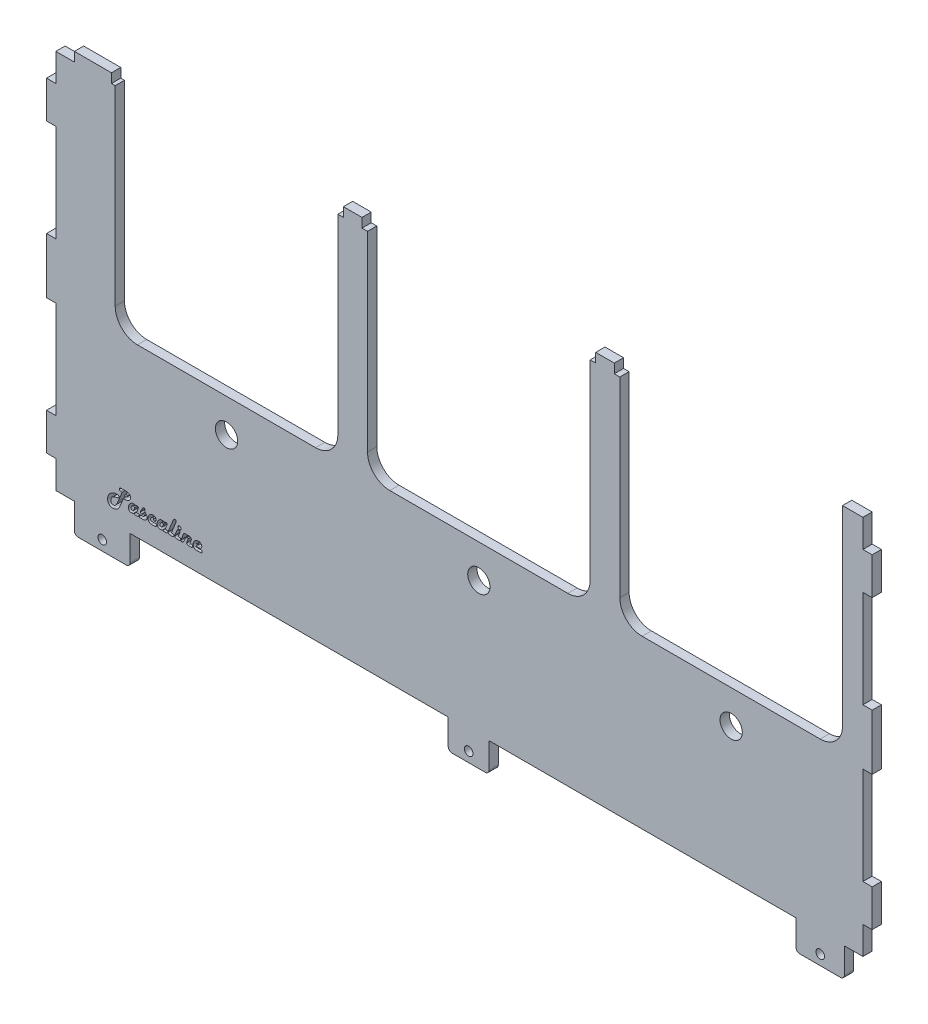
from build123d import *

# Parameters (mm, degrees)
SKETCH1_R             = 3.81
BOSS_EXTRUDE1_DEPTH   = 3.175
FILLET1_R             = 7.62
SKETCH2_W             = 6.35
SKETCH2_H             = 3.175
SKETCH2_W_2           = 3.175
SKETCH2_H_2           = 12.7
SKETCH2_H_3           = 19.05
SKETCH2_W_3           = 19.05
SKETCH2_H_4           = 10.033
SKETCH2_W_4           = 13.97
SKETCH2_W_5           = 16.51
SKETCH2_W_6           = 12.7
BOSS_EXTRUDE2_DEPTH   = 3.175
F_4_CLEARANCE_HOLE1_D = 2.9464
FILLET2_R             = 1.27
CUT_EXTRUDE1_DEPTH    = 310.607272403


with BuildPart() as part:
    # Sketch1 → Boss-Extrude1 (new body)
    with BuildSketch(Plane.XY):
        Polygon((0, 0), (276.225, 0), (276.225, 130.175), (269.24, 130.175), (269.24, 57.15), (193.04, 57.15), (193.04, 130.175), (182.88, 130.175), (182.88, 57.15), (106.68, 57.15), (106.68, 130.175), (96.52, 130.175), (96.52, 57.15), (20.32, 57.15), (20.32, 130.175), (0, 130.175), align=None)
        with Locations((231.14, 45.72)):
            Circle(SKETCH1_R, mode=Mode.SUBTRACT)
        with Locations((58.42, 45.72)):
            Circle(SKETCH1_R, mode=Mode.SUBTRACT)
        with Locations(Location((144.78, 45.72, 0), (0, 0, 180))):
            Circle(SKETCH1_R, mode=Mode.SUBTRACT)
    extrude(amount=BOSS_EXTRUDE1_DEPTH)

    # Fillet1
    fillet1_edges = [part.edges().sort_by_distance(p)[0] for p in [
        (20.32, 57.15, 1.5875),
        (96.52, 57.15, 1.5875),
        (106.68, 57.15, 1.5875),
        (182.88, 57.15, 1.5875),
        (193.04, 57.15, 1.5875),
        (269.24, 57.15, 1.5875),
    ]]
    fillet(fillet1_edges, radius=FILLET1_R)

    # Sketch2 → Boss-Extrude2 (add)
    with BuildSketch(Plane.XY):
        with Locations((187.96, 131.7625)):
            Rectangle(SKETCH2_W, SKETCH2_H)
        with Locations((277.8125, 114.3)):
            Rectangle(SKETCH2_W_2, SKETCH2_H_2)
        with Locations((277.8125, 15.875)):
            Rectangle(SKETCH2_W_2, SKETCH2_H_2)
        with Locations((-1.5875, 65.0875)):
            Rectangle(SKETCH2_W_2, SKETCH2_H_3)
        with Locations((277.8125, 65.0875)):
            Rectangle(SKETCH2_W_2, SKETCH2_H_3)
        with Locations((-1.5875, 15.875)):
            Rectangle(SKETCH2_W_2, SKETCH2_H_2)
        with Locations((-1.5875, 114.3)):
            Rectangle(SKETCH2_W_2, SKETCH2_H_2)
        with Locations((15.875, -5.0165)):
            Rectangle(SKETCH2_W_3, SKETCH2_H_4)
        with Locations((141.2875, -5.0165)):
            Rectangle(SKETCH2_W_4, SKETCH2_H_4)
        with Locations((261.62, -5.0165)):
            Rectangle(SKETCH2_W_5, SKETCH2_H_4)
        with Locations((101.6, 131.7625)):
            Rectangle(SKETCH2_W, SKETCH2_H)
        with Locations((12.7, 131.7625)):
            Rectangle(SKETCH2_W_6, SKETCH2_H)
    extrude(amount=BOSS_EXTRUDE2_DEPTH)

    # 4 Clearance Hole1 (through all)
    with Locations(Plane.XY.offset(3.175)):
        with Locations((141.2875, -6.604), (261.62, -6.604), (15.875, -6.604)):
            Hole(F_4_CLEARANCE_HOLE1_D / 2)

    # Fillet2
    fillet2_edges = [part.edges().sort_by_distance(p)[0] for p in [
        (269.875, -10.033, 1.5875),
        (253.365, -10.033, 1.5875),
        (148.2725, -10.033, 1.5875),
        (134.3025, -10.033, 1.5875),
        (25.4, -10.033, 1.5875),
        (6.35, -10.033, 1.5875),
    ]]
    fillet(fillet2_edges, radius=FILLET2_R)

    # Sketch5 → Cut-Extrude1 (cut, through all)
    # profile 1 of 10: a face of its own
    with BuildSketch(Plane.XY.offset(3.175)):
        with BuildLine():
            Line((23.119201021, 9.164609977), (22.451206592, 7.500566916))
            add(Edge.make_bspline(
                [(22.451206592, 7.500566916), (22.411003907, 7.401430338), (22.333829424, 7.211124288), (22.219435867, 6.938643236), (22.112680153, 6.690113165), (22.012786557, 6.465475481), (21.920717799, 6.264069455), (21.833533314, 6.087517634), (21.755963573, 5.933870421), (21.661354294, 5.762755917), (21.539114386, 5.572432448), (21.375027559, 5.364837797), (21.194459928, 5.172753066), (21.060129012, 5.059889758), (20.992791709, 5.003313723)],
                knots=[0, 0, 0, 0, 1.315970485, 2.526183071, 3.635244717, 4.643279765, 5.550454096, 6.359128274, 7.065363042, 7.667512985, 8.763908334, 9.843272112, 10.918877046, 12, 12, 12, 12], degree=3))
            add(Edge.make_bspline(
                [(20.992791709, 5.003313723), (20.941866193, 4.965231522), (20.841070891, 4.889856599), (20.680401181, 4.792052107), (20.514563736, 4.708473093), (20.341573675, 4.641675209), (20.163005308, 4.589417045), (19.978244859, 4.551262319), (19.787353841, 4.528037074), (19.658056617, 4.52556047), (19.592618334, 4.524307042)],
                knots=[0, 0, 0, 0, 1.011044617, 2.001129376, 2.987597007, 3.961339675, 4.946518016, 5.943976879, 6.959431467, 8, 8, 8, 8], degree=3))
            add(Edge.make_bspline(
                [(19.592618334, 4.524307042), (19.523985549, 4.52577862), (19.389812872, 4.52865546), (19.193870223, 4.554855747), (19.007122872, 4.594062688), (18.83078106, 4.653339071), (18.663334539, 4.726507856), (18.506601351, 4.817898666), (18.35966799, 4.925082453), (18.22480845, 5.048815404), (18.102569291, 5.184697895), (17.996369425, 5.332046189), (17.904994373, 5.488467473), (17.831448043, 5.655681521), (17.774055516, 5.832504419), (17.734367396, 6.018966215), (17.708307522, 6.214954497), (17.70541107, 6.3491208), (17.70392946, 6.417750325)],
                knots=[0, 0, 0, 0, 1.095039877, 2.140732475, 3.150521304, 4.13652018, 5.104897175, 6.062745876, 7.026672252, 8.00261995, 8.979018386, 9.939223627, 10.897072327, 11.865449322, 12.849478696, 13.859267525, 14.904960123, 16, 16, 16, 16], degree=3))
            add(Edge.make_bspline(
                [(17.70392946, 6.417750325), (17.706469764, 6.510196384), (17.711485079, 6.692712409), (17.750571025, 6.961954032), (17.814671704, 7.222484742), (17.905671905, 7.473969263), (18.021297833, 7.716830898), (18.16431112, 7.949570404), (18.332042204, 8.17426002), (18.460931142, 8.313119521), (18.526442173, 8.383698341)],
                knots=[0, 0, 0, 0, 1.01377589, 2.001495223, 2.977585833, 3.952291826, 4.930103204, 5.92294397, 6.944284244, 8, 8, 8, 8], degree=3))
            add(Edge.make_bspline(
                [(18.526442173, 8.383698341), (18.564038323, 8.421013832), (18.639923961, 8.496332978), (18.762383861, 8.601213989), (18.891389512, 8.701406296), (19.026342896, 8.796968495), (19.169837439, 8.884085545), (19.318539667, 8.968473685), (19.475608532, 9.044630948), (19.690708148, 9.141268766), (19.965425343, 9.241006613), (20.2978387, 9.328678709), (20.629749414, 9.381793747), (20.850767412, 9.389158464), (20.96069945, 9.392821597)],
                knots=[0, 0, 0, 0, 0.706155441, 1.425333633, 2.148189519, 2.883981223, 3.628821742, 4.385725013, 5.163077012, 5.955384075, 7.529784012, 9.053423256, 10.534403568, 12, 12, 12, 12], degree=3))
            add(Edge.make_bspline(
                [(20.96069945, 9.392821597), (21.010777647, 9.391629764), (21.10661754, 9.389348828), (21.242284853, 9.36101028), (21.363435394, 9.317754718), (21.467338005, 9.255678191), (21.552788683, 9.180085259), (21.616087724, 9.091135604), (21.653226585, 8.989078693), (21.657440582, 8.917283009), (21.659597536, 8.880534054)],
                knots=[0, 0, 0, 0, 1.238826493, 2.370872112, 3.417595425, 4.41258701, 5.350953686, 6.225146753, 7.091533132, 8, 8, 8, 8], degree=3))
            add(Edge.make_bspline(
                [(21.659597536, 8.880534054), (21.657158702, 8.841764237), (21.65240403, 8.766179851), (21.612518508, 8.658791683), (21.545055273, 8.564566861), (21.48423124, 8.515858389), (21.452780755, 8.490672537)],
                knots=[0, 0, 0, 0, 1.010937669, 1.970891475, 2.950802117, 4, 4, 4, 4], degree=3))
            add(Edge.make_bspline(
                [(21.452780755, 8.490672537), (21.428650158, 8.476261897), (21.374303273, 8.443806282), (21.271172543, 8.413087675), (21.142728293, 8.387298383), (21.04721528, 8.377274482), (20.995168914, 8.371812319)],
                knots=[0, 0, 0, 0, 0.704559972, 1.586808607, 2.68501851, 4, 4, 4, 4], degree=3))
            add(Edge.make_bspline(
                [(20.995168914, 8.371812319), (20.930899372, 8.36533971), (20.80556437, 8.352717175), (20.622961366, 8.323144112), (20.44919412, 8.289935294), (20.285218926, 8.246571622), (20.130183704, 8.19766871), (19.983692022, 8.144126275), (19.847574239, 8.080489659), (19.761927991, 8.032764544), (19.719798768, 8.009288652)],
                knots=[0, 0, 0, 0, 1.159710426, 2.261604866, 3.320677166, 4.335395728, 5.305245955, 6.239579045, 7.134052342, 8, 8, 8, 8], degree=3))
            add(Edge.make_bspline(
                [(19.719798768, 8.009288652), (19.654419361, 7.967339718), (19.52562533, 7.884702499), (19.354426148, 7.733222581), (19.203332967, 7.564964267), (19.075629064, 7.379109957), (18.973627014, 7.181271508), (18.89879096, 6.976254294), (18.852926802, 6.765270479), (18.847636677, 6.622412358), (18.844987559, 6.550873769)],
                knots=[0, 0, 0, 0, 1.047576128, 2.063670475, 3.075290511, 4.094745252, 5.099666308, 6.072755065, 7.034899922, 8, 8, 8, 8], degree=3))
            add(Edge.make_bspline(
                [(18.844987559, 6.550873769), (18.845636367, 6.515185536), (18.846908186, 6.445228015), (18.857899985, 6.343133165), (18.875018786, 6.246246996), (18.901788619, 6.15588907), (18.933862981, 6.070634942), (18.972695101, 5.990387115), (19.020918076, 5.917086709), (19.073977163, 5.848438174), (19.13513267, 5.788442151), (19.199905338, 5.73415304), (19.271326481, 5.690354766), (19.346543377, 5.652700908), (19.427352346, 5.624580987), (19.513023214, 5.604540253), (19.603256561, 5.590584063), (19.665464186, 5.589730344), (19.697215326, 5.589294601)],
                knots=[0, 0, 0, 0, 1.180906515, 2.314860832, 3.395146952, 4.432720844, 5.428859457, 6.408284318, 7.375873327, 8.328235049, 9.274073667, 10.205991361, 11.119268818, 12.040047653, 12.985704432, 13.943108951, 14.9501506, 16, 16, 16, 16], degree=3))
            add(Edge.make_bspline(
                [(19.697215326, 5.589294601), (19.73772721, 5.590178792), (19.817696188, 5.591924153), (19.934736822, 5.613557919), (20.047745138, 5.64535598), (20.156538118, 5.691126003), (20.261491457, 5.749525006), (20.361851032, 5.821430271), (20.457232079, 5.906838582), (20.550130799, 6.005691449), (20.640514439, 6.122252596), (20.735291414, 6.255321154), (20.829339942, 6.410668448), (20.926497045, 6.585296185), (21.026287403, 6.779583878), (21.128874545, 6.99369617), (21.231187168, 7.22917089), (21.299659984, 7.393110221), (21.335109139, 7.477983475)],
                knots=[0, 0, 0, 0, 0.731682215, 1.444313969, 2.14503258, 2.851587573, 3.573238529, 4.31284086, 5.079201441, 5.885132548, 6.76239785, 7.744387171, 8.838039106, 10.04403949, 11.357848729, 12.787140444, 14.336666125, 16, 16, 16, 16], degree=3))
            Line((21.335109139, 7.477983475), (22.730528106, 10.914232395))
            Line((22.730528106, 10.914232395), (22.293122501, 10.914232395))
            add(Edge.make_bspline(
                [(22.293122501, 10.914232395), (22.249482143, 10.915318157), (22.167784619, 10.917350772), (22.053469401, 10.933486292), (21.955911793, 10.96103767), (21.875553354, 11.001448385), (21.812083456, 11.0538411), (21.766552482, 11.118910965), (21.739607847, 11.196317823), (21.737016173, 11.251577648), (21.735668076, 11.280321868)],
                knots=[0, 0, 0, 0, 1.386647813, 2.595892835, 3.659749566, 4.594681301, 5.434731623, 6.248703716, 7.089037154, 8, 8, 8, 8], degree=3))
            add(Edge.make_bspline(
                [(21.735668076, 11.280321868), (21.737604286, 11.321461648), (21.741339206, 11.400819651), (21.780099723, 11.512122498), (21.841922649, 11.609323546), (21.930694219, 11.688476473), (22.040352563, 11.751577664), (22.17060237, 11.796320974), (22.320267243, 11.821779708), (22.426142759, 11.825246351), (22.482110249, 11.827078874)],
                knots=[0, 0, 0, 0, 0.942601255, 1.818263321, 2.674766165, 3.564433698, 4.523656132, 5.566505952, 6.713616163, 8, 8, 8, 8], degree=3))
            Line((22.482110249, 11.827078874), (24.009464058, 11.827078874))
            add(Edge.make_bspline(
                [(24.009464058, 11.827078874), (24.07248493, 11.826141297), (24.194705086, 11.824322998), (24.371659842, 11.811086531), (24.536158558, 11.790426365), (24.687661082, 11.7598162), (24.826003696, 11.719494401), (24.951704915, 11.670604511), (25.065549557, 11.614116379), (25.166457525, 11.546868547), (25.254881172, 11.47075861), (25.331318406, 11.384834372), (25.394973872, 11.289168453), (25.449869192, 11.185035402), (25.489653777, 11.069843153), (25.51766631, 10.945418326), (25.536143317, 10.81176616), (25.53815736, 10.719365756), (25.539195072, 10.671757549)],
                knots=[0, 0, 0, 0, 1.377685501, 2.671828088, 3.877302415, 5.000186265, 6.047243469, 7.023626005, 7.94558449, 8.820055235, 9.667510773, 10.489711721, 11.325757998, 12.174186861, 13.056345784, 13.980864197, 14.959664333, 16, 16, 16, 16], degree=3))
            add(Edge.make_bspline(
                [(25.539195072, 10.671757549), (25.537217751, 10.613032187), (25.533336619, 10.497764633), (25.507219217, 10.328808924), (25.461558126, 10.168586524), (25.398541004, 10.016101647), (25.315426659, 9.873155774), (25.215734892, 9.73744145), (25.098243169, 9.609536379), (25.007634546, 9.534438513), (24.961534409, 9.496229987)],
                knots=[0, 0, 0, 0, 1.037190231, 2.03582197, 3.010506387, 3.973515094, 4.942177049, 5.923321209, 6.943420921, 8, 8, 8, 8], degree=3))
            add(Edge.make_bspline(
                [(24.961534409, 9.496229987), (24.924861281, 9.469591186), (24.849567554, 9.414898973), (24.722279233, 9.347795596), (24.581294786, 9.290628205), (24.42582274, 9.24494617), (24.257052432, 9.208122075), (24.073914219, 9.182358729), (23.876613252, 9.166850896), (23.740077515, 9.16537344), (23.669523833, 9.164609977)],
                knots=[0, 0, 0, 0, 0.800437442, 1.643380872, 2.535600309, 3.486195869, 4.50417187, 5.586788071, 6.752993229, 8, 8, 8, 8], degree=3))
            Line((23.669523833, 9.164609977), (23.119201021, 9.164609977))
        make_face()
        with BuildLine():
            Line((23.509062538, 10.077456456), (23.833550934, 10.077456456))
            add(Edge.make_bspline(
                [(23.833550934, 10.077456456), (23.883581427, 10.078871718), (23.978009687, 10.081542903), (24.109812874, 10.105830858), (24.222265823, 10.147368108), (24.315221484, 10.206091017), (24.38842248, 10.283422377), (24.437974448, 10.379084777), (24.470358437, 10.489814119), (24.47287967, 10.569284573), (24.474207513, 10.611138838)],
                knots=[0, 0, 0, 0, 1.258971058, 2.376199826, 3.358208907, 4.260347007, 5.121448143, 6.005251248, 6.949436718, 8, 8, 8, 8], degree=3))
            add(Edge.make_bspline(
                [(24.474207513, 10.611138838), (24.473067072, 10.634992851), (24.470906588, 10.680182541), (24.45485612, 10.743618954), (24.424912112, 10.796445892), (24.384765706, 10.841296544), (24.331090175, 10.873849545), (24.267531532, 10.898068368), (24.192697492, 10.911946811), (24.139079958, 10.913437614), (24.110495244, 10.914232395)],
                knots=[0, 0, 0, 0, 1.057975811, 2.004258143, 2.869579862, 3.727735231, 4.644179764, 5.623179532, 6.73286349, 8, 8, 8, 8], degree=3))
            Line((24.110495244, 10.914232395), (23.84187115, 10.914232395))
            Line((23.84187115, 10.914232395), (23.509062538, 10.077456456))
        make_face(mode=Mode.SUBTRACT)
    # profile 2 of 10: a face of its own
    with BuildSketch(Plane.XY.offset(3.175)):
        with BuildLine():
            Line((27.590722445, 7.262846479), (28.032882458, 7.262846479))
            add(Edge.make_bspline(
                [(28.032882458, 7.262846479), (28.069771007, 7.26168404), (28.139217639, 7.259495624), (28.237100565, 7.244044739), (28.319497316, 7.213913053), (28.389453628, 7.175207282), (28.441730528, 7.120759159), (28.479643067, 7.055670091), (28.502815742, 6.978700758), (28.504866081, 6.923472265), (28.505946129, 6.894379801)],
                knots=[0, 0, 0, 0, 1.294214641, 2.436497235, 3.45633191, 4.35958604, 5.214514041, 6.067746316, 6.982155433, 8, 8, 8, 8], degree=3))
            add(Edge.make_bspline(
                [(28.505946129, 6.894379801), (28.504075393, 6.853751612), (28.500488, 6.775841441), (28.467922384, 6.66547908), (28.411237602, 6.570686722), (28.335484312, 6.489620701), (28.239850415, 6.426705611), (28.127852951, 6.380604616), (27.999107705, 6.355527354), (27.90818237, 6.351900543), (27.860535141, 6.35)],
                knots=[0, 0, 0, 0, 1.02006706, 1.956119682, 2.85821293, 3.77438774, 4.72208319, 5.713685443, 6.801912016, 8, 8, 8, 8], degree=3))
            Line((27.860535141, 6.35), (27.347058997, 6.35))
            add(Edge.make_bspline(
                [(27.347058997, 6.35), (27.319272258, 6.350924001), (27.266140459, 6.35269081), (27.189661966, 6.365809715), (27.119931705, 6.388489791), (27.056725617, 6.420297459), (27.001086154, 6.461923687), (26.951568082, 6.511009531), (26.909321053, 6.570088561), (26.888358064, 6.614676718), (26.877561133, 6.637641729)],
                knots=[0, 0, 0, 0, 1.135602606, 2.17141737, 3.159933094, 4.123316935, 5.049777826, 5.988893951, 6.964185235, 8, 8, 8, 8], degree=3))
            add(Edge.make_bspline(
                [(26.877561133, 6.637641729), (26.829418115, 6.593791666), (26.738706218, 6.511168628), (26.589078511, 6.421916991), (26.442765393, 6.360717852), (26.343224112, 6.353490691), (26.295146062, 6.35)],
                knots=[0, 0, 0, 0, 1.172355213, 2.208971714, 3.134940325, 4, 4, 4, 4], degree=3))
            Line((26.295146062, 6.35), (25.838722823, 6.35))
            add(Edge.make_bspline(
                [(25.838722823, 6.35), (25.802613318, 6.350846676), (25.732080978, 6.352500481), (25.629021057, 6.36739538), (25.530996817, 6.390336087), (25.439134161, 6.425910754), (25.351766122, 6.468220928), (25.269891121, 6.521254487), (25.194345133, 6.584489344), (25.123714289, 6.655720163), (25.061392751, 6.735720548), (25.004824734, 6.82093039), (24.958631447, 6.913392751), (24.9203783, 7.011259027), (24.891018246, 7.114802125), (24.869013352, 7.224008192), (24.857836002, 7.339477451), (24.855668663, 7.418533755), (24.854560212, 7.45896584)],
                knots=[0, 0, 0, 0, 1.038881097, 2.029236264, 2.991883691, 3.930308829, 4.858629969, 5.782385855, 6.730121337, 7.689859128, 8.664191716, 9.644845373, 10.629272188, 11.633194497, 12.665607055, 13.723595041, 14.835769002, 16, 16, 16, 16], degree=3))
            add(Edge.make_bspline(
                [(24.854560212, 7.45896584), (24.85610135, 7.520862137), (24.859147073, 7.643186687), (24.885247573, 7.824235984), (24.926425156, 8.000246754), (24.985151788, 8.171403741), (25.060821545, 8.33685869), (25.150817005, 8.498507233), (25.260719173, 8.653277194), (25.383466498, 8.802278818), (25.517065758, 8.939411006), (25.65634466, 9.060947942), (25.801550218, 9.162226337), (25.949498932, 9.247803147), (26.103529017, 9.312208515), (26.26118757, 9.359174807), (26.423717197, 9.387067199), (26.533554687, 9.390897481), (26.588730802, 9.392821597)],
                knots=[0, 0, 0, 0, 1.038393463, 2.052158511, 3.063456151, 4.068635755, 5.08344709, 6.113632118, 7.168837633, 8.264602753, 9.350863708, 10.378663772, 11.361961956, 12.31789787, 13.241700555, 14.156967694, 15.07416527, 16, 16, 16, 16], degree=3))
            add(Edge.make_bspline(
                [(26.588730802, 9.392821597), (26.629955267, 9.391802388), (26.709847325, 9.389827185), (26.825936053, 9.377663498), (26.93284671, 9.352720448), (27.032648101, 9.323430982), (27.12225627, 9.280706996), (27.204008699, 9.230733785), (27.277694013, 9.171469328), (27.318416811, 9.124076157), (27.338738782, 9.100425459)],
                knots=[0, 0, 0, 0, 1.187749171, 2.30183041, 3.353985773, 4.346587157, 5.291117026, 6.203238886, 7.103359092, 8, 8, 8, 8], degree=3))
            add(Edge.make_bspline(
                [(27.338738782, 9.100425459), (27.355674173, 9.123800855), (27.388572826, 9.169209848), (27.444893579, 9.229036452), (27.505129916, 9.279630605), (27.568893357, 9.321936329), (27.638154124, 9.352158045), (27.709275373, 9.377183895), (27.78560771, 9.389834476), (27.837518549, 9.391809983), (27.864100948, 9.392821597)],
                knots=[0, 0, 0, 0, 1.102961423, 2.142610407, 3.131917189, 4.106850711, 5.056016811, 6.014208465, 6.983119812, 8, 8, 8, 8], degree=3))
            add(Edge.make_bspline(
                [(27.864100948, 9.392821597), (27.892332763, 9.391374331), (27.947568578, 9.388542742), (28.026788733, 9.368747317), (28.097661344, 9.332619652), (28.159912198, 9.285477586), (28.212990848, 9.22913499), (28.25007614, 9.163329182), (28.274365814, 9.091402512), (28.276592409, 9.040801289), (28.277734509, 9.014846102)],
                knots=[0, 0, 0, 0, 1.085152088, 2.123110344, 3.11068521, 4.121931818, 5.11360817, 6.061884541, 7.005870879, 8, 8, 8, 8], degree=3))
            add(Edge.make_bspline(
                [(28.277734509, 9.014846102), (28.277038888, 8.995776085), (28.275563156, 8.955319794), (28.262690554, 8.892397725), (28.242496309, 8.824341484), (28.223506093, 8.778549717), (28.213549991, 8.754542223)],
                knots=[0, 0, 0, 0, 0.847236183, 1.797378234, 2.845219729, 4, 4, 4, 4], degree=3))
            Line((28.213549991, 8.754542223), (28.16957171, 8.648756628))
            Line((28.16957171, 8.648756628), (27.590722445, 7.262846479))
        make_face()
        with BuildLine():
            Line((26.134684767, 7.262846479), (26.235715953, 7.262846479))
            add(Edge.make_bspline(
                [(26.235715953, 7.262846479), (26.261118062, 7.263403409), (26.310245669, 7.264480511), (26.380704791, 7.276313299), (26.444219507, 7.296625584), (26.501442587, 7.324150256), (26.551533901, 7.360081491), (26.595304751, 7.403527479), (26.631459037, 7.455722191), (26.649532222, 7.494711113), (26.658858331, 7.514830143)],
                knots=[0, 0, 0, 0, 1.157664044, 2.238919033, 3.244614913, 4.190073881, 5.122668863, 6.042574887, 6.989931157, 8, 8, 8, 8], degree=3))
            Line((26.658858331, 7.514830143), (26.92985963, 8.166184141))
            add(Edge.make_bspline(
                [(26.92985963, 8.166184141), (26.946051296, 8.204845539), (26.974847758, 8.27360384), (26.981585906, 8.347699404), (26.98453533, 8.380132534)],
                knots=[0, 0, 0, 0, 1.124559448, 2, 2, 2, 2], degree=3))
            add(Edge.make_bspline(
                [(26.98453533, 8.380132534), (26.982919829, 8.396510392), (26.979660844, 8.429549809), (26.960273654, 8.478036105), (26.923140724, 8.519372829), (26.877468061, 8.558290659), (26.822149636, 8.591249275), (26.759781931, 8.614843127), (26.692035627, 8.629673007), (26.645070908, 8.631284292), (26.620823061, 8.632116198)],
                knots=[0, 0, 0, 0, 0.81058345, 1.635208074, 2.524363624, 3.523748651, 4.593951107, 5.683817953, 6.804157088, 8, 8, 8, 8], degree=3))
            add(Edge.make_bspline(
                [(26.620823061, 8.632116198), (26.596174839, 8.63128371), (26.546394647, 8.629602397), (26.472572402, 8.613117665), (26.399545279, 8.588130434), (26.327079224, 8.552743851), (26.255132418, 8.507577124), (26.183183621, 8.452598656), (26.113420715, 8.386315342), (26.021876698, 8.289084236), (25.923002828, 8.158030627), (25.834330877, 7.992365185), (25.778103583, 7.822683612), (25.770947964, 7.707389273), (25.767406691, 7.650330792)],
                knots=[0, 0, 0, 0, 0.627706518, 1.267732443, 1.919531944, 2.592823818, 3.31892668, 4.082778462, 4.897707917, 5.769757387, 7.487317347, 9.064628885, 10.547302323, 12, 12, 12, 12], degree=3))
            add(Edge.make_bspline(
                [(25.767406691, 7.650330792), (25.768547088, 7.620143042), (25.770712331, 7.562826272), (25.786711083, 7.482537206), (25.814989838, 7.413874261), (25.857126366, 7.358291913), (25.910530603, 7.314821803), (25.97542406, 7.283164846), (26.051786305, 7.265877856), (26.106072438, 7.263892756), (26.134684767, 7.262846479)],
                knots=[0, 0, 0, 0, 1.183693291, 2.247450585, 3.194323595, 4.070859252, 4.954393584, 5.871857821, 6.878330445, 8, 8, 8, 8], degree=3))
        make_face(mode=Mode.SUBTRACT)
    # profile 3 of 10: a face of its own
    with BuildSketch(Plane.XY.offset(3.175)):
        with BuildLine():
            Line((29.990510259, 8.330211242), (29.912062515, 8.16024113))
            add(Edge.make_bspline(
                [(29.912062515, 8.16024113), (29.896884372, 8.131312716), (29.86769618, 8.07568219), (29.814544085, 8.00141012), (29.757815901, 7.937540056), (29.695046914, 7.885850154), (29.628129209, 7.844607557), (29.555769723, 7.815808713), (29.478606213, 7.79887687), (29.425612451, 7.796534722), (29.39858637, 7.795340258)],
                knots=[0, 0, 0, 0, 1.174117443, 2.257875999, 3.277186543, 4.239058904, 5.172954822, 6.09414408, 7.028039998, 8, 8, 8, 8], degree=3))
            add(Edge.make_bspline(
                [(29.39858637, 7.795340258), (29.371134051, 7.796795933), (29.316667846, 7.799684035), (29.237096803, 7.82031378), (29.16263589, 7.855638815), (29.09462143, 7.902428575), (29.037107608, 7.958103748), (28.993789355, 8.019877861), (28.967174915, 8.086882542), (28.963967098, 8.133470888), (28.962369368, 8.156675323)],
                knots=[0, 0, 0, 0, 1.057292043, 2.097698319, 3.142574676, 4.21811325, 5.26521749, 6.20945791, 7.108177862, 8, 8, 8, 8], degree=3))
            add(Edge.make_bspline(
                [(28.962369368, 8.156675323), (28.963902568, 8.18098518), (28.967274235, 8.234445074), (28.992789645, 8.318434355), (29.027799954, 8.414397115), (29.061029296, 8.47951667), (29.078852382, 8.514444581)],
                knots=[0, 0, 0, 0, 0.768398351, 1.68978755, 2.760880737, 4, 4, 4, 4], degree=3))
            Line((29.078852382, 8.514444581), (29.612534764, 9.55209429))
            add(Edge.make_bspline(
                [(29.612534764, 9.55209429), (29.628998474, 9.581760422), (29.660355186, 9.638262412), (29.714608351, 9.714353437), (29.771846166, 9.778597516), (29.830813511, 9.833390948), (29.894697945, 9.874194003), (29.961322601, 9.90314064), (30.030689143, 9.921974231), (30.078349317, 9.92419981), (30.102238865, 9.925315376)],
                knots=[0, 0, 0, 0, 1.254889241, 2.390056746, 3.44940031, 4.435704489, 5.358962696, 6.23882182, 7.117213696, 8, 8, 8, 8], degree=3))
            add(Edge.make_bspline(
                [(30.102238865, 9.925315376), (30.127723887, 9.924333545), (30.177477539, 9.922416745), (30.249027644, 9.902648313), (30.314253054, 9.870016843), (30.371649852, 9.82561983), (30.422350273, 9.775108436), (30.456581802, 9.715249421), (30.480139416, 9.651678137), (30.482550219, 9.606987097), (30.483780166, 9.584186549)],
                knots=[0, 0, 0, 0, 1.076175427, 2.100985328, 3.113101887, 4.142426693, 5.162150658, 6.116677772, 7.039163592, 8, 8, 8, 8], degree=3))
            add(Edge.make_bspline(
                [(30.483780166, 9.584186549), (30.483189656, 9.576625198), (30.481707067, 9.55764097), (30.472108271, 9.524410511), (30.457923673, 9.48041725), (30.445526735, 9.447837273), (30.438613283, 9.429668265)],
                knots=[0, 0, 0, 0, 0.562304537, 1.411773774, 2.556613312, 4, 4, 4, 4], degree=3))
            add(Edge.make_bspline(
                [(30.438613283, 9.429668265), (30.429934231, 9.4021552), (30.4139082, 9.351351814), (30.409658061, 9.29828798), (30.407709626, 9.273961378)],
                knots=[0, 0, 0, 0, 1.083119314, 2, 2, 2, 2], degree=3))
            add(Edge.make_bspline(
                [(30.407709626, 9.273961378), (30.410360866, 9.231672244), (30.41576673, 9.145444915), (30.457407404, 9.016624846), (30.521341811, 8.886134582), (30.581783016, 8.805145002), (30.613337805, 8.762862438)],
                knots=[0, 0, 0, 0, 0.903479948, 1.84219102, 2.873463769, 4, 4, 4, 4], degree=3))
            Line((30.613337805, 8.762862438), (30.862944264, 8.449071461))
            add(Edge.make_bspline(
                [(30.862944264, 8.449071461), (30.89315876, 8.40941273), (30.95181765, 8.332418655), (31.029517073, 8.213642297), (31.096639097, 8.096689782), (31.150204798, 7.979553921), (31.192582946, 7.863611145), (31.222000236, 7.748525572), (31.241056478, 7.634323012), (31.243346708, 7.558484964), (31.244485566, 7.520773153)],
                knots=[0, 0, 0, 0, 1.169686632, 2.270847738, 3.328397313, 4.331060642, 5.289870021, 6.221237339, 7.115478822, 8, 8, 8, 8], degree=3))
            add(Edge.make_bspline(
                [(31.244485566, 7.520773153), (31.243374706, 7.479898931), (31.241185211, 7.399336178), (31.222953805, 7.281348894), (31.193158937, 7.168541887), (31.151222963, 7.060930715), (31.097710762, 6.958280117), (31.031457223, 6.861340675), (30.953690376, 6.769443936), (30.865170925, 6.683679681), (30.768195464, 6.604874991), (30.663003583, 6.537900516), (30.55370701, 6.478341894), (30.437152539, 6.432662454), (30.315721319, 6.395108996), (30.188203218, 6.369932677), (30.055210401, 6.351843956), (29.964426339, 6.35062387), (29.918005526, 6.35)],
                knots=[0, 0, 0, 0, 0.993241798, 1.957671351, 2.894532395, 3.824635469, 4.759513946, 5.702543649, 6.673110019, 7.681185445, 8.695042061, 9.70491044, 10.708882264, 11.715852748, 12.742665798, 13.794825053, 14.872423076, 16, 16, 16, 16], degree=3))
            Line((29.918005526, 6.35), (29.080040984, 6.35))
            add(Edge.make_bspline(
                [(29.080040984, 6.35), (29.041166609, 6.351148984), (28.968164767, 6.353306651), (28.865667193, 6.368799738), (28.778850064, 6.39860707), (28.70672086, 6.439016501), (28.649687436, 6.491477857), (28.609138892, 6.556610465), (28.58673032, 6.634252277), (28.583643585, 6.689400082), (28.582016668, 6.718466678)],
                knots=[0, 0, 0, 0, 1.323532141, 2.485449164, 3.513452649, 4.431917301, 5.281225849, 6.123328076, 7.010867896, 8, 8, 8, 8], degree=3))
            add(Edge.make_bspline(
                [(28.582016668, 6.718466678), (28.583766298, 6.759131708), (28.587126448, 6.837228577), (28.621444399, 6.947402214), (28.678777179, 7.042559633), (28.758030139, 7.122462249), (28.857096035, 7.185049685), (28.972704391, 7.232327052), (29.105937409, 7.257322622), (29.199599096, 7.26094353), (29.248822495, 7.262846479)],
                knots=[0, 0, 0, 0, 1.001377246, 1.923137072, 2.813709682, 3.719614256, 4.674449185, 5.687788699, 6.784829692, 8, 8, 8, 8], degree=3))
            Line((29.248822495, 7.262846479), (29.71356595, 7.262846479))
            add(Edge.make_bspline(
                [(29.71356595, 7.262846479), (29.761976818, 7.263714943), (29.852890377, 7.265345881), (29.979460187, 7.28416678), (30.087169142, 7.314282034), (30.176102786, 7.356875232), (30.246912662, 7.412505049), (30.297305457, 7.482368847), (30.326991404, 7.565690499), (30.330040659, 7.625120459), (30.331639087, 7.656273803)],
                knots=[0, 0, 0, 0, 1.402558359, 2.633945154, 3.698995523, 4.63394819, 5.475307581, 6.281836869, 7.099334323, 8, 8, 8, 8], degree=3))
            add(Edge.make_bspline(
                [(30.331639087, 7.656273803), (30.329759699, 7.681390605), (30.325750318, 7.734973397), (30.29981842, 7.817251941), (30.260510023, 7.906123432), (30.223911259, 7.964172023), (30.204458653, 7.995025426)],
                knots=[0, 0, 0, 0, 0.822745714, 1.755200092, 2.806866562, 4, 4, 4, 4], degree=3))
            Line((30.204458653, 7.995025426), (29.990510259, 8.330211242))
        make_face()
    # profile 4 of 10: a face of its own
    with BuildSketch(Plane.XY.offset(3.175)):
        with BuildLine():
            Line((33.843958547, 6.35), (32.680317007, 6.35))
            add(Edge.make_bspline(
                [(32.680317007, 6.35), (32.639473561, 6.351331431), (32.559475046, 6.353939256), (32.442122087, 6.368805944), (32.331089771, 6.397249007), (32.224677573, 6.432858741), (32.125228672, 6.482977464), (32.031435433, 6.542005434), (31.943344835, 6.612135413), (31.862148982, 6.692296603), (31.788904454, 6.781373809), (31.723642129, 6.876673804), (31.67087138, 6.979950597), (31.624984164, 7.087986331), (31.590247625, 7.203147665), (31.567630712, 7.324780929), (31.550914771, 7.452170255), (31.549492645, 7.539336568), (31.548767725, 7.583769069)],
                knots=[0, 0, 0, 0, 1.04308008, 2.043041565, 3.012085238, 3.965374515, 4.901770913, 5.84746328, 6.790555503, 7.770466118, 8.754752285, 9.731054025, 10.712842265, 11.710345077, 12.724731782, 13.776116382, 14.86638876, 16, 16, 16, 16], degree=3))
            add(Edge.make_bspline(
                [(31.548767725, 7.583769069), (31.550434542, 7.643669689), (31.553726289, 7.761965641), (31.577855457, 7.936444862), (31.618616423, 8.105181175), (31.675046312, 8.268099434), (31.750410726, 8.42377383), (31.839361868, 8.574392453), (31.946140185, 8.718148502), (32.065971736, 8.855189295), (32.19833574, 8.979735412), (32.336825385, 9.090917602), (32.481896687, 9.184309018), (32.632077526, 9.261377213), (32.789231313, 9.319248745), (32.951349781, 9.362816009), (33.119703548, 9.388030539), (33.233728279, 9.391214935), (33.29125853, 9.392821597)],
                knots=[0, 0, 0, 0, 1.033018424, 2.040077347, 3.031267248, 4.023304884, 5.007568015, 6.009629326, 7.036117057, 8.091719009, 9.145549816, 10.16692925, 11.15074152, 12.116516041, 13.072326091, 14.033738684, 15.007938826, 16, 16, 16, 16], degree=3))
            add(Edge.make_bspline(
                [(33.29125853, 9.392821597), (33.330123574, 9.39229061), (33.406065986, 9.391253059), (33.516835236, 9.378681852), (33.62234278, 9.360223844), (33.721984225, 9.332564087), (33.816684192, 9.298575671), (33.904919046, 9.254933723), (33.988753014, 9.205465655), (34.065535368, 9.147041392), (34.135215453, 9.083436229), (34.197063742, 9.015218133), (34.248354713, 8.941154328), (34.289538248, 8.862143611), (34.324343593, 8.779529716), (34.345526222, 8.691155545), (34.361010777, 8.598583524), (34.362575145, 8.535117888), (34.363377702, 8.502558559)],
                knots=[0, 0, 0, 0, 1.192851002, 2.330834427, 3.419016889, 4.478598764, 5.502444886, 6.503631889, 7.49680333, 8.487139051, 9.460210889, 10.390750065, 11.308717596, 12.217610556, 13.123567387, 14.053072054, 15.001181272, 16, 16, 16, 16], degree=3))
            add(Edge.make_bspline(
                [(34.363377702, 8.502558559), (34.361783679, 8.458384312), (34.358716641, 8.37338923), (34.328641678, 8.252278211), (34.283123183, 8.141976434), (34.216010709, 8.047284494), (34.135293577, 7.969033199), (34.041830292, 7.91161127), (33.936681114, 7.87676091), (33.862847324, 7.873225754), (33.824940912, 7.871410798)],
                knots=[0, 0, 0, 0, 1.140049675, 2.193554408, 3.207776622, 4.208142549, 5.171800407, 6.095933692, 7.022448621, 8, 8, 8, 8], degree=3))
            add(Edge.make_bspline(
                [(33.824940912, 7.871410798), (33.795542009, 7.87215502), (33.740311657, 7.873553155), (33.663568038, 7.888085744), (33.597715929, 7.909794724), (33.543778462, 7.942790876), (33.500419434, 7.984790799), (33.471820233, 8.038507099), (33.453420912, 8.100004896), (33.451523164, 8.144247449), (33.450531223, 8.167372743)],
                knots=[0, 0, 0, 0, 1.293872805, 2.430738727, 3.43019671, 4.33150824, 5.195698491, 6.055468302, 6.983605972, 8, 8, 8, 8], degree=3))
            add(Edge.make_bspline(
                [(33.450531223, 8.167372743), (33.450531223, 8.181239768), (33.450531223, 8.206596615), (33.450531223, 8.231953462), (33.450531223, 8.243443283)],
                knots=[0, 0, 0, 0, 1.09375, 2, 2, 2, 2], degree=3))
            add(Edge.make_bspline(
                [(33.450531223, 8.243443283), (33.450531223, 8.255725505), (33.450531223, 8.279497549), (33.450531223, 8.303269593), (33.450531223, 8.314759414)],
                knots=[0, 0, 0, 0, 1.033333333, 2, 2, 2, 2], degree=3))
            add(Edge.make_bspline(
                [(33.450531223, 8.314759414), (33.44967953, 8.333876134), (33.448077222, 8.369840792), (33.434613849, 8.419916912), (33.413511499, 8.463087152), (33.380914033, 8.497551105), (33.339478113, 8.523737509), (33.289753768, 8.542520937), (33.231618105, 8.554749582), (33.189901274, 8.555594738), (33.167643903, 8.556045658)],
                knots=[0, 0, 0, 0, 1.076936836, 2.026062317, 2.906040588, 3.760364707, 4.665822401, 5.649858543, 6.746118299, 8, 8, 8, 8], degree=3))
            add(Edge.make_bspline(
                [(33.167643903, 8.556045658), (33.123621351, 8.553163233), (33.034942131, 8.547356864), (32.906677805, 8.495910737), (32.786484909, 8.413771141), (32.676556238, 8.304885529), (32.583034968, 8.177699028), (32.511892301, 8.039385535), (32.470278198, 7.891609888), (32.464516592, 7.790439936), (32.461614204, 7.739475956)],
                knots=[0, 0, 0, 0, 0.889989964, 1.79279967, 2.759962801, 3.828151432, 4.914528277, 5.949409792, 6.967022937, 8, 8, 8, 8], degree=3))
            add(Edge.make_bspline(
                [(32.461614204, 7.739475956), (32.463855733, 7.699247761), (32.468094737, 7.623171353), (32.500732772, 7.517048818), (32.560782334, 7.431656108), (32.643809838, 7.363978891), (32.755272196, 7.317078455), (32.894754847, 7.2858988), (33.064490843, 7.266324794), (33.187790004, 7.264066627), (33.254411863, 7.262846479)],
                knots=[0, 0, 0, 0, 0.913027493, 1.726645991, 2.482782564, 3.249916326, 4.127695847, 5.201188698, 6.487726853, 8, 8, 8, 8], degree=3))
            Line((33.254411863, 7.262846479), (34.012740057, 7.262846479))
            add(Edge.make_bspline(
                [(34.012740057, 7.262846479), (34.052054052, 7.261906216), (34.125991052, 7.260137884), (34.229054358, 7.242045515), (34.317391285, 7.214818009), (34.390470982, 7.173472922), (34.447565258, 7.119330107), (34.488145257, 7.052929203), (34.510965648, 6.974664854), (34.513940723, 6.919099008), (34.515518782, 6.889625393)],
                knots=[0, 0, 0, 0, 1.322009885, 2.486276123, 3.511116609, 4.419281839, 5.287086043, 6.131096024, 7.008683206, 8, 8, 8, 8], degree=3))
            add(Edge.make_bspline(
                [(34.515518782, 6.889625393), (34.513867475, 6.849711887), (34.510676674, 6.772587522), (34.474586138, 6.664416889), (34.416987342, 6.569236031), (34.336227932, 6.489587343), (34.236195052, 6.426608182), (34.119790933, 6.380845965), (33.986884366, 6.355420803), (33.893195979, 6.351867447), (33.843958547, 6.35)],
                knots=[0, 0, 0, 0, 0.982987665, 1.899414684, 2.782606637, 3.710260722, 4.674394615, 5.685217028, 6.783478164, 8, 8, 8, 8], degree=3))
        make_face()
    # profile 5 of 10: a face of its own
    with BuildSketch(Plane.XY.offset(3.175)):
        with BuildLine():
            Line((37.403822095, 7.262846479), (37.845982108, 7.262846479))
            add(Edge.make_bspline(
                [(37.845982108, 7.262846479), (37.882870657, 7.26168404), (37.952317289, 7.259495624), (38.050200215, 7.244044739), (38.132596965, 7.213913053), (38.202553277, 7.175207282), (38.254830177, 7.120759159), (38.292742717, 7.055670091), (38.315915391, 6.978700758), (38.31796573, 6.923472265), (38.319045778, 6.894379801)],
                knots=[0, 0, 0, 0, 1.294214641, 2.436497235, 3.45633191, 4.35958604, 5.214514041, 6.067746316, 6.982155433, 8, 8, 8, 8], degree=3))
            add(Edge.make_bspline(
                [(38.319045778, 6.894379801), (38.317175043, 6.853751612), (38.313587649, 6.775841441), (38.281022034, 6.66547908), (38.224337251, 6.570686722), (38.148583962, 6.489620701), (38.052950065, 6.426705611), (37.9409526, 6.380604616), (37.812207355, 6.355527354), (37.721282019, 6.351900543), (37.673634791, 6.35)],
                knots=[0, 0, 0, 0, 1.02006706, 1.956119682, 2.85821293, 3.77438774, 4.72208319, 5.713685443, 6.801912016, 8, 8, 8, 8], degree=3))
            Line((37.673634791, 6.35), (37.160158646, 6.35))
            add(Edge.make_bspline(
                [(37.160158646, 6.35), (37.132371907, 6.350924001), (37.079240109, 6.35269081), (37.002761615, 6.365809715), (36.933031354, 6.388489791), (36.869825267, 6.420297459), (36.814185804, 6.461923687), (36.764667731, 6.511009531), (36.722420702, 6.570088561), (36.701457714, 6.614676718), (36.690660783, 6.637641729)],
                knots=[0, 0, 0, 0, 1.135602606, 2.17141737, 3.159933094, 4.123316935, 5.049777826, 5.988893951, 6.964185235, 8, 8, 8, 8], degree=3))
            add(Edge.make_bspline(
                [(36.690660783, 6.637641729), (36.642517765, 6.593791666), (36.551805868, 6.511168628), (36.402178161, 6.421916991), (36.255865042, 6.360717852), (36.156323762, 6.353490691), (36.108245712, 6.35)],
                knots=[0, 0, 0, 0, 1.172355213, 2.208971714, 3.134940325, 4, 4, 4, 4], degree=3))
            Line((36.108245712, 6.35), (35.651822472, 6.35))
            add(Edge.make_bspline(
                [(35.651822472, 6.35), (35.615712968, 6.350846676), (35.545180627, 6.352500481), (35.442120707, 6.36739538), (35.344096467, 6.390336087), (35.252233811, 6.425910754), (35.164865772, 6.468220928), (35.082990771, 6.521254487), (35.007444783, 6.584489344), (34.936813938, 6.655720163), (34.8744924, 6.735720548), (34.817924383, 6.82093039), (34.771731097, 6.913392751), (34.733477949, 7.011259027), (34.704117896, 7.114802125), (34.682113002, 7.224008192), (34.670935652, 7.339477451), (34.668768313, 7.418533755), (34.667659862, 7.45896584)],
                knots=[0, 0, 0, 0, 1.038881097, 2.029236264, 2.991883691, 3.930308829, 4.858629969, 5.782385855, 6.730121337, 7.689859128, 8.664191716, 9.644845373, 10.629272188, 11.633194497, 12.665607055, 13.723595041, 14.835769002, 16, 16, 16, 16], degree=3))
            add(Edge.make_bspline(
                [(34.667659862, 7.45896584), (34.669201, 7.520862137), (34.672246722, 7.643186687), (34.698347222, 7.824235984), (34.739524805, 8.000246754), (34.798251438, 8.171403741), (34.873921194, 8.33685869), (34.963916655, 8.498507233), (35.073818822, 8.653277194), (35.196566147, 8.802278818), (35.330165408, 8.939411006), (35.46944431, 9.060947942), (35.614649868, 9.162226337), (35.762598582, 9.247803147), (35.916628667, 9.312208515), (36.07428722, 9.359174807), (36.236816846, 9.387067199), (36.346654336, 9.390897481), (36.401830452, 9.392821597)],
                knots=[0, 0, 0, 0, 1.038393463, 2.052158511, 3.063456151, 4.068635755, 5.08344709, 6.113632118, 7.168837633, 8.264602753, 9.350863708, 10.378663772, 11.361961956, 12.31789787, 13.241700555, 14.156967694, 15.07416527, 16, 16, 16, 16], degree=3))
            add(Edge.make_bspline(
                [(36.401830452, 9.392821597), (36.443054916, 9.391802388), (36.522946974, 9.389827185), (36.639035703, 9.377663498), (36.74594636, 9.352720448), (36.845747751, 9.323430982), (36.935355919, 9.280706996), (37.017108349, 9.230733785), (37.090793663, 9.171469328), (37.131516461, 9.124076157), (37.151838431, 9.100425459)],
                knots=[0, 0, 0, 0, 1.187749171, 2.30183041, 3.353985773, 4.346587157, 5.291117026, 6.203238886, 7.103359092, 8, 8, 8, 8], degree=3))
            add(Edge.make_bspline(
                [(37.151838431, 9.100425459), (37.168773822, 9.123800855), (37.201672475, 9.169209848), (37.257993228, 9.229036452), (37.318229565, 9.279630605), (37.381993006, 9.321936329), (37.451253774, 9.352158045), (37.522375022, 9.377183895), (37.598707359, 9.389834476), (37.650618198, 9.391809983), (37.677200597, 9.392821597)],
                knots=[0, 0, 0, 0, 1.102961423, 2.142610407, 3.131917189, 4.106850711, 5.056016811, 6.014208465, 6.983119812, 8, 8, 8, 8], degree=3))
            add(Edge.make_bspline(
                [(37.677200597, 9.392821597), (37.705432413, 9.391374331), (37.760668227, 9.388542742), (37.839888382, 9.368747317), (37.910760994, 9.332619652), (37.973011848, 9.285477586), (38.026090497, 9.22913499), (38.06317579, 9.163329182), (38.087465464, 9.091402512), (38.089692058, 9.040801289), (38.090834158, 9.014846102)],
                knots=[0, 0, 0, 0, 1.085152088, 2.123110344, 3.11068521, 4.121931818, 5.11360817, 6.061884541, 7.005870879, 8, 8, 8, 8], degree=3))
            add(Edge.make_bspline(
                [(38.090834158, 9.014846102), (38.090138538, 8.995776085), (38.088662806, 8.955319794), (38.075790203, 8.892397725), (38.055595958, 8.824341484), (38.036605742, 8.778549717), (38.02664964, 8.754542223)],
                knots=[0, 0, 0, 0, 0.847236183, 1.797378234, 2.845219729, 4, 4, 4, 4], degree=3))
            Line((38.02664964, 8.754542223), (37.982671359, 8.648756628))
            Line((37.982671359, 8.648756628), (37.403822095, 7.262846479))
        make_face()
        with BuildLine():
            Line((35.947784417, 7.262846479), (36.048815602, 7.262846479))
            add(Edge.make_bspline(
                [(36.048815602, 7.262846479), (36.074217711, 7.263403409), (36.123345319, 7.264480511), (36.19380444, 7.276313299), (36.257319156, 7.296625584), (36.314542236, 7.324150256), (36.364633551, 7.360081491), (36.4084044, 7.403527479), (36.444558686, 7.455722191), (36.462631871, 7.494711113), (36.471957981, 7.514830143)],
                knots=[0, 0, 0, 0, 1.157664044, 2.238919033, 3.244614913, 4.190073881, 5.122668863, 6.042574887, 6.989931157, 8, 8, 8, 8], degree=3))
            Line((36.471957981, 7.514830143), (36.742959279, 8.166184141))
            add(Edge.make_bspline(
                [(36.742959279, 8.166184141), (36.759150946, 8.204845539), (36.787947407, 8.27360384), (36.794685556, 8.347699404), (36.79763498, 8.380132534)],
                knots=[0, 0, 0, 0, 1.124559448, 2, 2, 2, 2], degree=3))
            add(Edge.make_bspline(
                [(36.79763498, 8.380132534), (36.796019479, 8.396510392), (36.792760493, 8.429549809), (36.773373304, 8.478036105), (36.736240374, 8.519372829), (36.69056771, 8.558290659), (36.635249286, 8.591249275), (36.572881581, 8.614843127), (36.505135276, 8.629673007), (36.458170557, 8.631284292), (36.433922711, 8.632116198)],
                knots=[0, 0, 0, 0, 0.81058345, 1.635208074, 2.524363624, 3.523748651, 4.593951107, 5.683817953, 6.804157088, 8, 8, 8, 8], degree=3))
            add(Edge.make_bspline(
                [(36.433922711, 8.632116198), (36.409274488, 8.63128371), (36.359494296, 8.629602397), (36.285672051, 8.613117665), (36.212644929, 8.588130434), (36.140178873, 8.552743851), (36.068232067, 8.507577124), (35.99628327, 8.452598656), (35.926520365, 8.386315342), (35.834976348, 8.289084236), (35.736102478, 8.158030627), (35.647430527, 7.992365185), (35.591203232, 7.822683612), (35.584047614, 7.707389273), (35.580506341, 7.650330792)],
                knots=[0, 0, 0, 0, 0.627706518, 1.267732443, 1.919531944, 2.592823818, 3.31892668, 4.082778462, 4.897707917, 5.769757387, 7.487317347, 9.064628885, 10.547302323, 12, 12, 12, 12], degree=3))
            add(Edge.make_bspline(
                [(35.580506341, 7.650330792), (35.581646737, 7.620143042), (35.58381198, 7.562826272), (35.599810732, 7.482537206), (35.628089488, 7.413874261), (35.670226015, 7.358291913), (35.723630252, 7.314821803), (35.788523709, 7.283164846), (35.864885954, 7.265877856), (35.919172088, 7.263892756), (35.947784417, 7.262846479)],
                knots=[0, 0, 0, 0, 1.183693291, 2.247450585, 3.194323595, 4.070859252, 4.954393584, 5.871857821, 6.878330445, 8, 8, 8, 8], degree=3))
        make_face(mode=Mode.SUBTRACT)
    # profile 6 of 10: a face of its own
    with BuildSketch(Plane.XY.offset(3.175)):
        with BuildLine():
            Line((39.54330603, 7.262846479), (39.964071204, 7.262846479))
            add(Edge.make_bspline(
                [(39.964071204, 7.262846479), (40.002196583, 7.261905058), (40.073773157, 7.260137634), (40.173354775, 7.242145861), (40.258430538, 7.21455385), (40.328942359, 7.173454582), (40.383609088, 7.11886309), (40.42260496, 7.052624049), (40.445990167, 6.974752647), (40.447970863, 6.919118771), (40.449020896, 6.889625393)],
                knots=[0, 0, 0, 0, 1.309452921, 2.458366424, 3.466370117, 4.370442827, 5.237320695, 6.092345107, 6.988688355, 8, 8, 8, 8], degree=3))
            add(Edge.make_bspline(
                [(40.449020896, 6.889625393), (40.447172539, 6.849379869), (40.443628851, 6.772220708), (40.410674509, 6.662826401), (40.354637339, 6.568445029), (40.278306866, 6.487978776), (40.181022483, 6.426596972), (40.067670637, 6.380781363), (39.936642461, 6.355345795), (39.844129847, 6.351847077), (39.795289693, 6.35)],
                knots=[0, 0, 0, 0, 1.005849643, 1.928425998, 2.826684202, 3.731762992, 4.678240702, 5.683992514, 6.777310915, 8, 8, 8, 8], degree=3))
            Line((39.795289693, 6.35), (39.073808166, 6.35))
            add(Edge.make_bspline(
                [(39.073808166, 6.35), (39.024104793, 6.3511204), (38.929397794, 6.353255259), (38.796033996, 6.382209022), (38.676940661, 6.423380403), (38.576584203, 6.485782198), (38.495272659, 6.562202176), (38.435788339, 6.652638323), (38.402076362, 6.756603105), (38.397478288, 6.829563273), (38.395116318, 6.867041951)],
                knots=[0, 0, 0, 0, 1.241664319, 2.36592195, 3.401368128, 4.381172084, 5.300106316, 6.174896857, 7.062468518, 8, 8, 8, 8], degree=3))
            add(Edge.make_bspline(
                [(38.395116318, 6.867041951), (38.396820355, 6.891314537), (38.400783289, 6.947763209), (38.426103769, 7.040904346), (38.463269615, 7.154591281), (38.495268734, 7.23606788), (38.512787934, 7.280675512)],
                knots=[0, 0, 0, 0, 0.674710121, 1.569115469, 2.669114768, 4, 4, 4, 4], degree=3))
            Line((38.512787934, 7.280675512), (40.156624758, 11.269624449))
            Line((40.156624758, 11.269624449), (40.200603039, 11.377787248))
            add(Edge.make_bspline(
                [(40.200603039, 11.377787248), (40.216217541, 11.413587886), (40.246179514, 11.482284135), (40.305952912, 11.573107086), (40.370159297, 11.65166252), (40.441516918, 11.716981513), (40.521220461, 11.766228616), (40.607611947, 11.801209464), (40.700702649, 11.823225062), (40.765462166, 11.825777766), (40.798469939, 11.827078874)],
                knots=[0, 0, 0, 0, 1.172057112, 2.249008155, 3.255426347, 4.216793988, 5.142151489, 6.055552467, 7.008919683, 8, 8, 8, 8], degree=3))
            add(Edge.make_bspline(
                [(40.798469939, 11.827078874), (40.825920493, 11.825652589), (40.879616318, 11.822862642), (40.957619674, 11.802461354), (41.028264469, 11.765925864), (41.090955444, 11.717396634), (41.142843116, 11.659734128), (41.182670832, 11.595411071), (41.205959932, 11.523955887), (41.208462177, 11.474226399), (41.209726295, 11.449103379)],
                knots=[0, 0, 0, 0, 1.062046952, 2.077462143, 3.092414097, 4.119914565, 5.129756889, 6.079111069, 7.029579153, 8, 8, 8, 8], degree=3))
            add(Edge.make_bspline(
                [(41.209726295, 11.449103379), (41.20909523, 11.428441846), (41.207786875, 11.385605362), (41.194478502, 11.319713), (41.175877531, 11.249663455), (41.158246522, 11.202532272), (41.149107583, 11.17810208)],
                knots=[0, 0, 0, 0, 0.886930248, 1.83882642, 2.879767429, 4, 4, 4, 4], degree=3))
            Line((41.149107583, 11.17810208), (41.105129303, 11.071127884))
            Line((41.105129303, 11.071127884), (39.54330603, 7.262846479))
        make_face()
    # profile 7 of 10: a face of its own
    with BuildSketch(Plane.XY.offset(3.175)):
        with BuildLine():
            Line((41.789764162, 7.262846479), (42.242621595, 7.262846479))
            add(Edge.make_bspline(
                [(42.242621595, 7.262846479), (42.280736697, 7.261862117), (42.352684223, 7.260003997), (42.452770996, 7.242389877), (42.538364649, 7.214203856), (42.609688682, 7.173848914), (42.66461192, 7.11885279), (42.703227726, 7.052418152), (42.728514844, 6.974996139), (42.730229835, 6.919162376), (42.731137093, 6.889625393)],
                knots=[0, 0, 0, 0, 1.304697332, 2.462796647, 3.467139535, 4.379611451, 5.243341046, 6.095260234, 6.992361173, 8, 8, 8, 8], degree=3))
            add(Edge.make_bspline(
                [(42.731137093, 6.889625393), (42.729430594, 6.849332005), (42.726153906, 6.77196377), (42.691223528, 6.663102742), (42.635735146, 6.567968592), (42.557990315, 6.488402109), (42.460572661, 6.426230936), (42.345779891, 6.38066451), (42.213189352, 6.355453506), (42.119508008, 6.351878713), (42.070274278, 6.35)],
                knots=[0, 0, 0, 0, 0.999806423, 1.919750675, 2.812612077, 3.719089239, 4.659880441, 5.668737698, 6.77481754, 8, 8, 8, 8], degree=3))
            Line((42.070274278, 6.35), (41.431994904, 6.35))
            add(Edge.make_bspline(
                [(41.431994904, 6.35), (41.376431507, 6.351856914), (41.270967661, 6.355381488), (41.121241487, 6.380775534), (40.990465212, 6.4260805), (40.877888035, 6.48709218), (40.788242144, 6.56634996), (40.723001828, 6.659858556), (40.684553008, 6.767566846), (40.679725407, 6.843357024), (40.677232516, 6.882493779)],
                knots=[0, 0, 0, 0, 1.286858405, 2.442561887, 3.501884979, 4.479685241, 5.389631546, 6.247460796, 7.095018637, 8, 8, 8, 8], degree=3))
            add(Edge.make_bspline(
                [(40.677232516, 6.882493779), (40.67872995, 6.905923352), (40.681953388, 6.956358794), (40.697945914, 7.036256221), (40.726401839, 7.124356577), (40.750186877, 7.185320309), (40.762811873, 7.217679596)],
                knots=[0, 0, 0, 0, 0.809405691, 1.742359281, 2.801653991, 4, 4, 4, 4], degree=3))
            Line((40.762811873, 7.217679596), (41.43556071, 8.831801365))
            Line((41.43556071, 8.831801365), (41.479538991, 8.94352997))
            add(Edge.make_bspline(
                [(41.479538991, 8.94352997), (41.495767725, 8.979199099), (41.526754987, 9.047305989), (41.584545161, 9.139675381), (41.65045709, 9.216928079), (41.721708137, 9.2831716), (41.802633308, 9.331930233), (41.890127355, 9.366968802), (41.984410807, 9.388962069), (42.049947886, 9.391518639), (42.083348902, 9.392821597)],
                knots=[0, 0, 0, 0, 1.169726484, 2.233484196, 3.241125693, 4.19639886, 5.12596356, 6.044540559, 7.003398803, 8, 8, 8, 8], degree=3))
            add(Edge.make_bspline(
                [(42.083348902, 9.392821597), (42.111217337, 9.391464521), (42.165352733, 9.388828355), (42.24365817, 9.367717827), (42.315487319, 9.333117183), (42.379270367, 9.28518985), (42.433485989, 9.229524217), (42.474563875, 9.166557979), (42.497800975, 9.09643038), (42.501195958, 9.047892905), (42.502925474, 9.023166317)],
                knots=[0, 0, 0, 0, 1.079075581, 2.096141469, 3.119681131, 4.151827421, 5.172944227, 6.118867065, 7.04168896, 8, 8, 8, 8], degree=3))
            add(Edge.make_bspline(
                [(42.502925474, 9.023166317), (42.501208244, 8.999685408), (42.497285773, 8.946050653), (42.473384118, 8.858863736), (42.439230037, 8.754470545), (42.407349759, 8.681382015), (42.390008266, 8.641625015)],
                knots=[0, 0, 0, 0, 0.704844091, 1.609994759, 2.699940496, 4, 4, 4, 4], degree=3))
            Line((42.390008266, 8.641625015), (41.789764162, 7.262846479))
        make_face()
    # profile 8 of 10: a face of its own
    with BuildSketch(Plane.XY.offset(3.175)):
        with BuildLine():
            add(Edge.make_bspline(
                [(42.312749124, 10.686020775), (42.35098851, 10.683948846), (42.425999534, 10.679884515), (42.534063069, 10.648189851), (42.632081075, 10.594152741), (42.719488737, 10.52223134), (42.791410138, 10.434823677), (42.845447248, 10.336805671), (42.877141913, 10.228742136), (42.881206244, 10.153731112), (42.883278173, 10.115491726)],
                knots=[0, 0, 0, 0, 1.022434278, 2.00562427, 2.98307932, 4, 5.01692068, 5.99437573, 6.977565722, 8, 8, 8, 8], degree=3))
            add(Edge.make_bspline(
                [(42.883278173, 10.115491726), (42.881206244, 10.07725234), (42.877141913, 10.002241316), (42.845447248, 9.89417778), (42.791410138, 9.796159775), (42.719488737, 9.708752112), (42.632081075, 9.636830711), (42.534063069, 9.582793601), (42.425999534, 9.551098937), (42.35098851, 9.547034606), (42.312749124, 9.544962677)],
                knots=[0, 0, 0, 0, 1.022434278, 2.00562427, 2.98307932, 4, 5.01692068, 5.99437573, 6.977565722, 8, 8, 8, 8], degree=3))
            add(Edge.make_bspline(
                [(42.312749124, 9.544962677), (42.274509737, 9.547034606), (42.199498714, 9.551098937), (42.091435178, 9.582793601), (41.993417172, 9.636830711), (41.90600951, 9.708752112), (41.834088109, 9.796159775), (41.780050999, 9.89417778), (41.748356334, 10.002241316), (41.744292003, 10.07725234), (41.742220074, 10.115491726)],
                knots=[0, 0, 0, 0, 1.022434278, 2.00562427, 2.98307932, 4, 5.01692068, 5.99437573, 6.977565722, 8, 8, 8, 8], degree=3))
            add(Edge.make_bspline(
                [(41.742220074, 10.115491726), (41.744292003, 10.153731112), (41.748356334, 10.228742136), (41.780050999, 10.336805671), (41.834088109, 10.434823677), (41.90600951, 10.52223134), (41.993417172, 10.594152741), (42.091435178, 10.648189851), (42.199498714, 10.679884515), (42.274509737, 10.683948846), (42.312749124, 10.686020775)],
                knots=[0, 0, 0, 0, 1.022434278, 2.00562427, 2.98307932, 4, 5.01692068, 5.99437573, 6.977565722, 8, 8, 8, 8], degree=3))
        make_face()
    # profile 9 of 10: a face of its own
    with BuildSketch(Plane.XY.offset(3.175)):
        with BuildLine():
            Line((45.852406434, 7.262846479), (46.33379032, 7.262846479))
            add(Edge.make_bspline(
                [(46.33379032, 7.262846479), (46.3734953, 7.26191626), (46.447818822, 7.260174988), (46.551356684, 7.242145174), (46.639762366, 7.214405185), (46.713691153, 7.174246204), (46.769847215, 7.118882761), (46.810128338, 7.052775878), (46.834785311, 6.974892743), (46.837506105, 6.919137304), (46.838946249, 6.889625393)],
                knots=[0, 0, 0, 0, 1.332122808, 2.493592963, 3.515972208, 4.433507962, 5.28966748, 6.131650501, 7.011063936, 8, 8, 8, 8], degree=3))
            add(Edge.make_bspline(
                [(46.838946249, 6.889625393), (46.837352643, 6.849299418), (46.834287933, 6.771747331), (46.797691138, 6.663020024), (46.741108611, 6.567530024), (46.660689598, 6.487937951), (46.560413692, 6.426872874), (46.443757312, 6.380359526), (46.309453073, 6.355613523), (46.214624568, 6.351928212), (46.165008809, 6.35)],
                knots=[0, 0, 0, 0, 0.989273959, 1.902502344, 2.790953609, 3.701572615, 4.657126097, 5.664420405, 6.777988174, 8, 8, 8, 8], degree=3))
            Line((46.165008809, 6.35), (45.327044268, 6.35))
            add(Edge.make_bspline(
                [(45.327044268, 6.35), (45.290017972, 6.351788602), (45.218062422, 6.355264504), (45.115045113, 6.383438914), (45.021633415, 6.429678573), (44.938761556, 6.492035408), (44.870663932, 6.56933659), (44.821280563, 6.657675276), (44.789552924, 6.75557435), (44.786577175, 6.824397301), (44.785041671, 6.859910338)],
                knots=[0, 0, 0, 0, 1.06919643, 2.077837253, 3.061385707, 4.06709547, 5.057357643, 6.016388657, 6.97644519, 8, 8, 8, 8], degree=3))
            add(Edge.make_bspline(
                [(44.785041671, 6.859910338), (44.7863485, 6.884961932), (44.789281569, 6.941188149), (44.811132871, 7.032534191), (44.839982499, 7.141270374), (44.867587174, 7.217876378), (44.88250705, 7.259280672)],
                knots=[0, 0, 0, 0, 0.728058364, 1.634066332, 2.72125148, 4, 4, 4, 4], degree=3))
            Line((44.88250705, 7.259280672), (45.189166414, 8.112697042))
            add(Edge.make_bspline(
                [(45.189166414, 8.112697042), (45.203665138, 8.152690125), (45.22913537, 8.222946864), (45.237752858, 8.297086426), (45.241464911, 8.32902264)],
                knots=[0, 0, 0, 0, 1.138483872, 2, 2, 2, 2], degree=3))
            add(Edge.make_bspline(
                [(45.241464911, 8.32902264), (45.240977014, 8.344172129), (45.240019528, 8.373902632), (45.226232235, 8.417527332), (45.200746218, 8.457190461), (45.164170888, 8.490732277), (45.12233102, 8.521335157), (45.071890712, 8.540771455), (45.016812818, 8.55494658), (44.977699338, 8.555670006), (44.957388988, 8.556045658)],
                knots=[0, 0, 0, 0, 0.891014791, 1.748594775, 2.662913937, 3.638243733, 4.662752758, 5.700245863, 6.805812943, 8, 8, 8, 8], degree=3))
            add(Edge.make_bspline(
                [(44.957388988, 8.556045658), (44.924326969, 8.554116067), (44.85826004, 8.550260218), (44.761877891, 8.522057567), (44.670966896, 8.474398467), (44.586303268, 8.407461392), (44.505747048, 8.323434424), (44.43304525, 8.219273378), (44.361783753, 8.099183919), (44.322868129, 8.009791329), (44.302469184, 7.962933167)],
                knots=[0, 0, 0, 0, 0.844704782, 1.68795045, 2.544298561, 3.454102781, 4.435689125, 5.509683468, 6.694616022, 8, 8, 8, 8], degree=3))
            Line((44.302469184, 7.962933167), (43.836537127, 6.855155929))
            add(Edge.make_bspline(
                [(43.836537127, 6.855155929), (43.8187913, 6.815093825), (43.784904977, 6.738593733), (43.722361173, 6.63547109), (43.654630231, 6.547193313), (43.579529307, 6.475044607), (43.497198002, 6.418936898), (43.408174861, 6.379574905), (43.312895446, 6.35478057), (43.247141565, 6.351611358), (43.213709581, 6.35)],
                knots=[0, 0, 0, 0, 1.228540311, 2.345943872, 3.375718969, 4.343035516, 5.255843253, 6.156722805, 7.062801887, 8, 8, 8, 8], degree=3))
            add(Edge.make_bspline(
                [(43.213709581, 6.35), (43.186253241, 6.350961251), (43.132999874, 6.352825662), (43.056330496, 6.37257492), (42.986617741, 6.405369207), (42.924012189, 6.448465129), (42.872180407, 6.502064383), (42.835177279, 6.563553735), (42.810672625, 6.630709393), (42.808376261, 6.677840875), (42.807207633, 6.701826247)],
                knots=[0, 0, 0, 0, 1.09983931, 2.133210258, 3.150310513, 4.177917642, 5.167433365, 6.116266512, 7.041361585, 8, 8, 8, 8], degree=3))
            add(Edge.make_bspline(
                [(42.807207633, 6.701826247), (42.807775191, 6.720923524), (42.808981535, 6.76151481), (42.82417858, 6.823910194), (42.84213012, 6.892898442), (42.861268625, 6.938956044), (42.871392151, 6.963318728)],
                knots=[0, 0, 0, 0, 0.84408435, 1.794102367, 2.833165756, 4, 4, 4, 4], degree=3))
            Line((42.871392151, 6.963318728), (42.915370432, 7.069104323))
            Line((42.915370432, 7.069104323), (43.722431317, 9.013657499))
            add(Edge.make_bspline(
                [(43.722431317, 9.013657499), (43.736024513, 9.043705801), (43.762174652, 9.101511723), (43.810788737, 9.179819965), (43.867823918, 9.245088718), (43.931099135, 9.299456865), (44.002307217, 9.341662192), (44.080331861, 9.371242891), (44.164921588, 9.389742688), (44.223526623, 9.391774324), (44.253736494, 9.392821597)],
                knots=[0, 0, 0, 0, 1.133500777, 2.180591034, 3.155994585, 4.103301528, 5.037982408, 5.986855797, 6.962259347, 8, 8, 8, 8], degree=3))
            add(Edge.make_bspline(
                [(44.253736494, 9.392821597), (44.278378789, 9.392405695), (44.326457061, 9.391594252), (44.395334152, 9.377530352), (44.459894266, 9.357992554), (44.517905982, 9.327638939), (44.571276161, 9.290693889), (44.618320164, 9.24428565), (44.659875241, 9.189780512), (44.68216389, 9.148695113), (44.693519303, 9.127763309)],
                knots=[0, 0, 0, 0, 1.084507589, 2.115925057, 3.08838965, 4.049487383, 4.989875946, 5.941237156, 6.951120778, 8, 8, 8, 8], degree=3))
            add(Edge.make_bspline(
                [(44.693519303, 9.127763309), (44.76345287, 9.168604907), (44.897850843, 9.247094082), (45.10806668, 9.328351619), (45.312009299, 9.38273803), (45.447566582, 9.389516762), (45.513654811, 9.392821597)],
                knots=[0, 0, 0, 0, 1.112280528, 2.137575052, 3.092012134, 4, 4, 4, 4], degree=3))
            add(Edge.make_bspline(
                [(45.513654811, 9.392821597), (45.574092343, 9.390414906), (45.690709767, 9.385771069), (45.857457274, 9.347168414), (46.007883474, 9.2825976), (46.137922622, 9.191681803), (46.247310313, 9.084115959), (46.325460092, 8.957722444), (46.374461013, 8.817470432), (46.379791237, 8.718498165), (46.382523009, 8.667774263)],
                knots=[0, 0, 0, 0, 1.147170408, 2.213526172, 3.231603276, 4.238037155, 5.212112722, 6.124927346, 7.039013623, 8, 8, 8, 8], degree=3))
            add(Edge.make_bspline(
                [(46.382523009, 8.667774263), (46.381235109, 8.637985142), (46.378572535, 8.576399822), (46.360621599, 8.482157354), (46.333927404, 8.383113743), (46.307193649, 8.317674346), (46.293377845, 8.283855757)],
                knots=[0, 0, 0, 0, 0.901170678, 1.863058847, 2.895644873, 4, 4, 4, 4], degree=3))
            Line((46.293377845, 8.283855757), (45.852406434, 7.262846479))
        make_face()
    # profile 10 of 10: a face of its own
    with BuildSketch(Plane.XY.offset(3.175)):
        with BuildLine():
            add(Edge.make_bspline(
                [(47.950289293, 7.491058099), (47.95152998, 7.472981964), (47.95394454, 7.437803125), (47.977010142, 7.389091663), (48.014503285, 7.348644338), (48.066089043, 7.316871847), (48.130895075, 7.291819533), (48.209490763, 7.275127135), (48.302218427, 7.264433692), (48.368641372, 7.263401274), (48.404335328, 7.262846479)],
                knots=[0, 0, 0, 0, 0.764367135, 1.48757176, 2.238468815, 3.079136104, 4.038989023, 5.178564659, 6.483834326, 8, 8, 8, 8], degree=3))
            Line((48.404335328, 7.262846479), (49.595314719, 7.262846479))
            add(Edge.make_bspline(
                [(49.595314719, 7.262846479), (49.6354148, 7.261898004), (49.710914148, 7.260112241), (49.816380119, 7.242065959), (49.906861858, 7.214654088), (49.982270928, 7.174268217), (50.039531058, 7.118941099), (50.081360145, 7.053124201), (50.105742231, 6.974850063), (50.108512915, 6.919122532), (50.109979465, 6.889625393)],
                knots=[0, 0, 0, 0, 1.329951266, 2.503996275, 3.539647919, 4.458105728, 5.313878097, 6.153119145, 7.022427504, 8, 8, 8, 8], degree=3))
            add(Edge.make_bspline(
                [(50.109979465, 6.889625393), (50.108390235, 6.849295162), (50.105333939, 6.77173489), (50.068678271, 6.663064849), (50.012167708, 6.567120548), (49.930371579, 6.487977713), (49.828765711, 6.426563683), (49.709576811, 6.380245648), (49.571746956, 6.355574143), (49.474166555, 6.351918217), (49.422967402, 6.35)],
                knots=[0, 0, 0, 0, 0.976933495, 1.878770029, 2.756138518, 3.662236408, 4.614048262, 5.626718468, 6.754770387, 8, 8, 8, 8], degree=3))
            Line((49.422967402, 6.35), (48.287852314, 6.35))
            add(Edge.make_bspline(
                [(48.287852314, 6.35), (48.236308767, 6.350834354), (48.136577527, 6.35244874), (47.991592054, 6.367110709), (47.85632986, 6.390213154), (47.730251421, 6.423759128), (47.613495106, 6.466321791), (47.505912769, 6.518290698), (47.408693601, 6.581185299), (47.320067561, 6.652019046), (47.242862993, 6.733971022), (47.173837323, 6.823044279), (47.11848838, 6.923083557), (47.07194765, 7.030566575), (47.034711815, 7.146704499), (47.00913881, 7.271823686), (46.993300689, 7.405861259), (46.991840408, 7.49814318), (46.991087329, 7.545733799)],
                knots=[0, 0, 0, 0, 1.227108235, 2.374322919, 3.466320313, 4.491595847, 5.476620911, 6.421800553, 7.32994879, 8.228786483, 9.116312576, 10.005091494, 10.905017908, 11.830449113, 12.791227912, 13.803396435, 14.867191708, 16, 16, 16, 16], degree=3))
            add(Edge.make_bspline(
                [(46.991087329, 7.545733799), (46.99263616, 7.607625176), (46.995687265, 7.729547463), (47.021387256, 7.909136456), (47.063392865, 8.082025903), (47.119753, 8.249557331), (47.195789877, 8.408958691), (47.286389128, 8.562811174), (47.395623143, 8.708659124), (47.517934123, 8.847885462), (47.651866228, 8.975525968), (47.795131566, 9.085964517), (47.943423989, 9.181178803), (48.098568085, 9.259141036), (48.260764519, 9.318215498), (48.428699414, 9.361332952), (48.602738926, 9.388479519), (48.721196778, 9.391362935), (48.781122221, 9.392821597)],
                knots=[0, 0, 0, 0, 1.040395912, 2.049517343, 3.043324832, 4.029374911, 5.015897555, 6.007693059, 7.027077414, 8.075019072, 9.12126503, 10.132759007, 11.112327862, 12.080685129, 13.046081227, 14.009175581, 14.992881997, 16, 16, 16, 16], degree=3))
            add(Edge.make_bspline(
                [(48.781122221, 9.392821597), (48.824324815, 9.391705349), (48.908910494, 9.389519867), (49.032680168, 9.378412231), (49.14924932, 9.356279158), (49.259827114, 9.328504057), (49.363451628, 9.289927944), (49.461149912, 9.243837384), (49.552125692, 9.189044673), (49.634873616, 9.125511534), (49.711412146, 9.057593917), (49.777115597, 8.981741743), (49.833371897, 8.901050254), (49.878514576, 8.814543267), (49.915054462, 8.723581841), (49.939345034, 8.626382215), (49.955575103, 8.524104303), (49.957075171, 8.453891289), (49.957838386, 8.418167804)],
                knots=[0, 0, 0, 0, 1.207786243, 2.364705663, 3.468027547, 4.520851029, 5.547315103, 6.552779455, 7.536484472, 8.5087175, 9.46512013, 10.391169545, 11.306498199, 12.207991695, 13.112743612, 14.039322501, 15.002432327, 16, 16, 16, 16], degree=3))
            add(Edge.make_bspline(
                [(49.957838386, 8.418167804), (49.956516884, 8.375685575), (49.953930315, 8.292535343), (49.932353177, 8.17214378), (49.896535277, 8.060702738), (49.847230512, 7.957438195), (49.782363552, 7.863126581), (49.703349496, 7.777415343), (49.610559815, 7.699624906), (49.540109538, 7.657686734), (49.50379235, 7.636067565)],
                knots=[0, 0, 0, 0, 1.069179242, 2.092698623, 3.067607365, 4.009120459, 4.963808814, 5.93825802, 6.937169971, 8, 8, 8, 8], degree=3))
            add(Edge.make_bspline(
                [(49.50379235, 7.636067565), (49.481876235, 7.623986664), (49.436531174, 7.598990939), (49.360714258, 7.571965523), (49.27850275, 7.546155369), (49.188021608, 7.527030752), (49.090284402, 7.509403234), (48.984500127, 7.500046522), (48.871178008, 7.492148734), (48.793025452, 7.491429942), (48.752595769, 7.491058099)],
                knots=[0, 0, 0, 0, 0.775768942, 1.605087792, 2.492325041, 3.450334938, 4.473645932, 5.574054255, 6.745015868, 8, 8, 8, 8], degree=3))
            Line((48.752595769, 7.491058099), (47.950289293, 7.491058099))
        make_face()
        with BuildLine():
            Line((48.142842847, 8.251763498), (48.585002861, 8.251763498))
            add(Edge.make_bspline(
                [(48.585002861, 8.251763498), (48.621868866, 8.252097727), (48.69052928, 8.252720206), (48.786093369, 8.260244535), (48.866570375, 8.269749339), (48.932164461, 8.284843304), (48.983201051, 8.30457975), (49.020499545, 8.328442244), (49.043380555, 8.359947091), (49.044458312, 8.382988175), (49.044991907, 8.39439576)],
                knots=[0, 0, 0, 0, 1.705094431, 3.175621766, 4.432939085, 5.451044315, 6.281582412, 6.952824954, 7.481546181, 8, 8, 8, 8], degree=3))
            add(Edge.make_bspline(
                [(49.044991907, 8.39439576), (49.043244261, 8.40721497), (49.039839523, 8.432189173), (49.024074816, 8.467036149), (48.997646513, 8.494487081), (48.964651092, 8.517743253), (48.92329066, 8.535195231), (48.874153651, 8.548286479), (48.816555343, 8.554797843), (48.775587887, 8.555612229), (48.753784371, 8.556045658)],
                knots=[0, 0, 0, 0, 0.838547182, 1.633645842, 2.4358048, 3.286135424, 4.243266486, 5.336598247, 6.582496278, 8, 8, 8, 8], degree=3))
            add(Edge.make_bspline(
                [(48.753784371, 8.556045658), (48.722425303, 8.55517955), (48.660954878, 8.553481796), (48.571248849, 8.538750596), (48.48645603, 8.51540872), (48.406957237, 8.481149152), (48.331909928, 8.439213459), (48.263571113, 8.385065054), (48.198644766, 8.323929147), (48.161645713, 8.276080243), (48.142842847, 8.251763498)],
                knots=[0, 0, 0, 0, 1.059074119, 2.076009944, 3.063613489, 4.023510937, 4.995010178, 5.959100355, 6.962817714, 8, 8, 8, 8], degree=3))
        make_face(mode=Mode.SUBTRACT)
    extrude(amount=-CUT_EXTRUDE1_DEPTH, mode=Mode.SUBTRACT)


with BuildPart() as cut_extrude1_piece_1:
    # of the separate pieces the step leaves, piece 1, a body of its own (cut_extrude1_pieces)
    add(part.part.solids().sort_by_distance((269.875, -8.763, 0))[0])


with BuildPart() as cut_extrude1_piece_2:
    # of the separate pieces the step leaves, piece 2, a body of its own (cut_extrude1_pieces)
    add(part.part.solids().sort_by_distance((26.134684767, 7.262846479, 0))[0])


with BuildPart() as cut_extrude1_piece_3:
    # of the separate pieces the step leaves, piece 3, a body of its own (cut_extrude1_pieces)
    add(part.part.solids().sort_by_distance((35.947784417, 7.262846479, 0))[0])


with BuildPart() as cut_extrude1_piece_4:
    # of the separate pieces the step leaves, piece 4, a body of its own (cut_extrude1_pieces)
    add(part.part.solids().sort_by_distance((23.84187115, 10.914232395, 0))[0])


with BuildPart() as cut_extrude1_piece_5:
    # of the separate pieces the step leaves, piece 5, a body of its own (cut_extrude1_pieces)
    add(part.part.solids().sort_by_distance((48.142842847, 8.251763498, 0))[0])


solid = Compound([cut_extrude1_piece_1.part, cut_extrude1_piece_2.part, cut_extrude1_piece_3.part, cut_extrude1_piece_4.part, cut_extrude1_piece_5.part])
